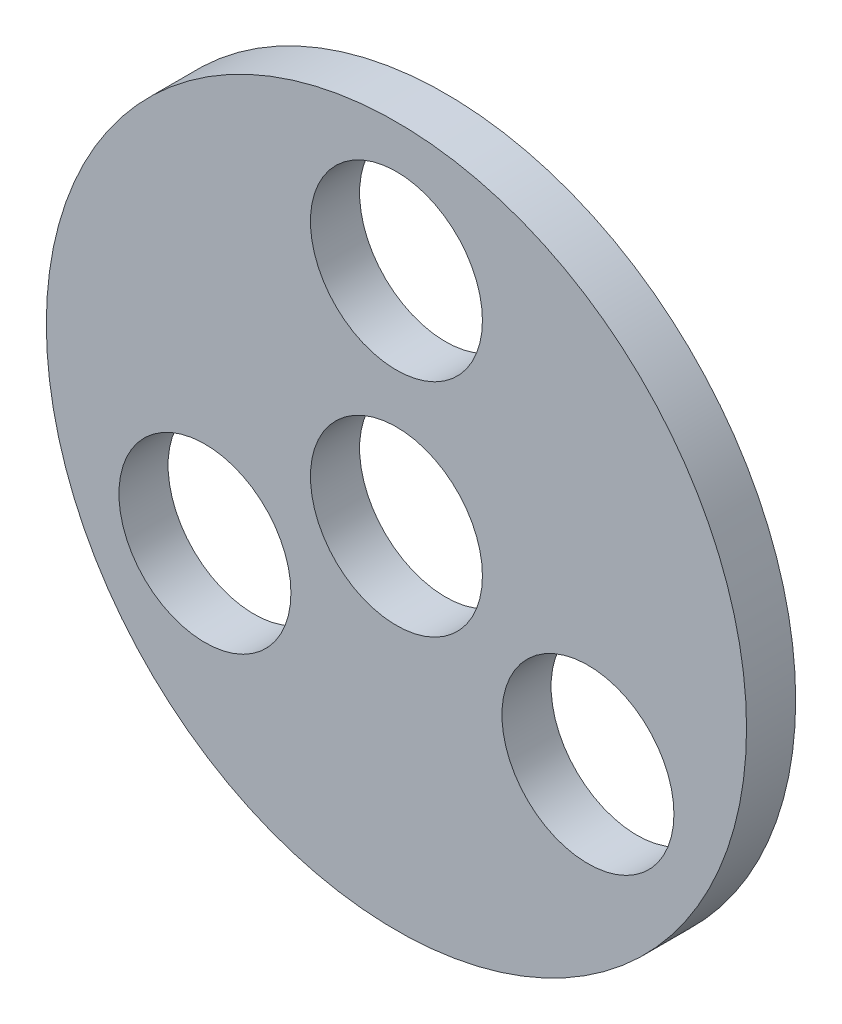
from build123d import *

# Parameters (mm, degrees)
ESQUISSE1_R      = 14.25
ESQUISSE1_R_2    = 3.5
EXTRUSION1_DEPTH = 2


with BuildPart() as part:
    # Esquisse1 → Extrusion1 (new body)
    with BuildSketch(Plane.XY):
        Circle(ESQUISSE1_R)
        with Locations((0, 9)):
            Circle(ESQUISSE1_R_2, mode=Mode.SUBTRACT)
        with Locations((7.794228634, -4.5)):
            Circle(ESQUISSE1_R_2, mode=Mode.SUBTRACT)
        with Locations((-7.794228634, -4.5)):
            Circle(ESQUISSE1_R_2, mode=Mode.SUBTRACT)
        Circle(ESQUISSE1_R_2, mode=Mode.SUBTRACT)
    extrude(amount=EXTRUSION1_DEPTH)


solid = part.part
